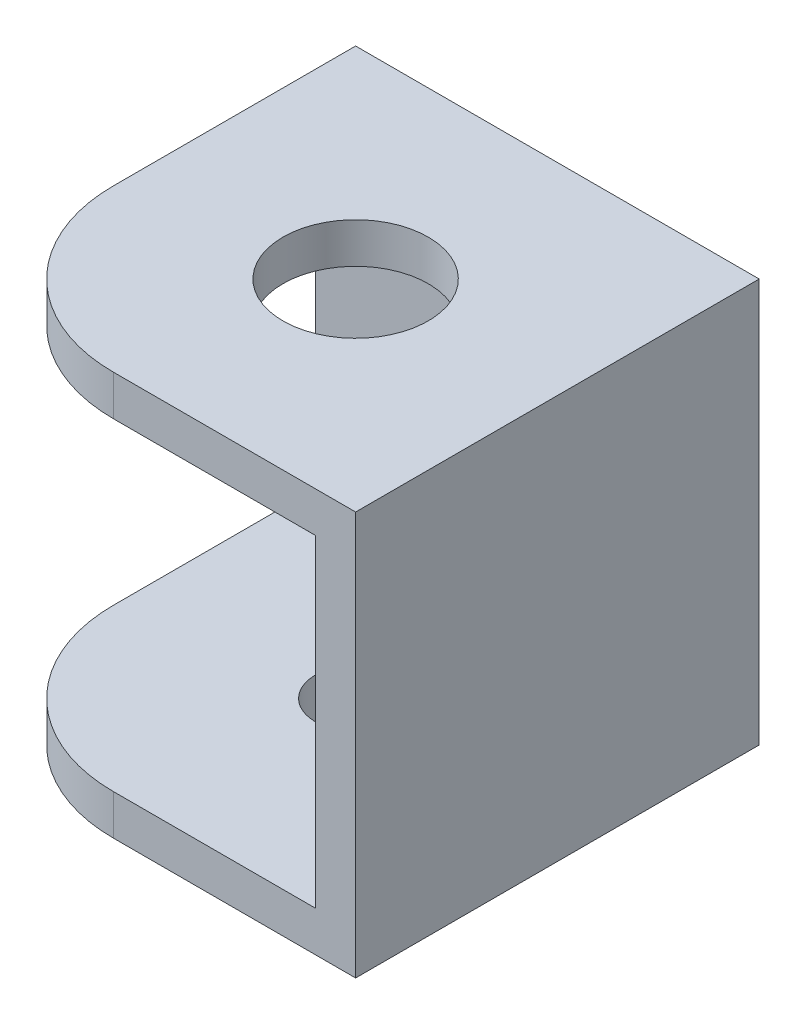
from build123d import *

# Parameters (mm, degrees)
EXTRUSION1_DEPTH        = 50
CONG_1_R                = 20
ESQUISSE2_W             = 45
ESQUISSE2_H             = 40
EXTRUSION2_DEPTH        = 5
ESQUISSE3_R             = 5
ENL_V_MAT_EXTRU_3_DEPTH = 87.23984767
ESQUISSE4_R             = 9
ENL_V_MAT_EXTRU_4_DEPTH = 5


with BuildPart() as part:
    # Esquisse1 → Extrusion1 (new body)
    with BuildSketch(Plane.XY):
        Polygon((-49.369133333, 10.168133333), (-4.369133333, 10.168133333), (-4.369133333, -29.831866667), (-49.369133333, -29.831866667), (-49.369133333, -34.831866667), (0.630866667, -34.831866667), (0.630866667, 15.168133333), (-49.369133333, 15.168133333), align=None)
    extrude(amount=EXTRUSION1_DEPTH)

    # Cong_1
    cong_1_edges = [part.edges().sort_by_distance(p)[0] for p in [
        (-49.369133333, -32.331866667, 50),
        (-49.369133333, 12.668133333, 50),
    ]]
    fillet(cong_1_edges, radius=CONG_1_R)

    # Esquisse2 → Extrusion2 (add)
    with BuildSketch(Plane(origin=(0, 0, 0), x_dir=(-1, 0, 0), z_dir=(0, 0, -1))):
        with Locations((26.869133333, -9.831866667)):
            Rectangle(ESQUISSE2_W, ESQUISSE2_H)
    extrude(amount=-EXTRUSION2_DEPTH)

    # Esquisse3 → Enl_v. mat.-Extru.3 (cut, through all)
    with BuildSketch(Plane.XZ.offset(34.831866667)):
        with Locations(Location((-24.369133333, 25, 0), (0, 0, 270))):
            Circle(ESQUISSE3_R)
    extrude(amount=-ENL_V_MAT_EXTRU_3_DEPTH, mode=Mode.SUBTRACT)

    # Esquisse4 → Enl_v. mat.-Extru.4 (cut)
    with BuildSketch(Plane(origin=(0, 15.168133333, 0), x_dir=(1, 0, 0), z_dir=(0, 1, 0))):
        with Locations(Location((-24.369133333, -25, 0), (0, 0, 180))):
            Circle(ESQUISSE4_R)
    extrude(amount=-ENL_V_MAT_EXTRU_4_DEPTH, mode=Mode.SUBTRACT)


solid = part.part
